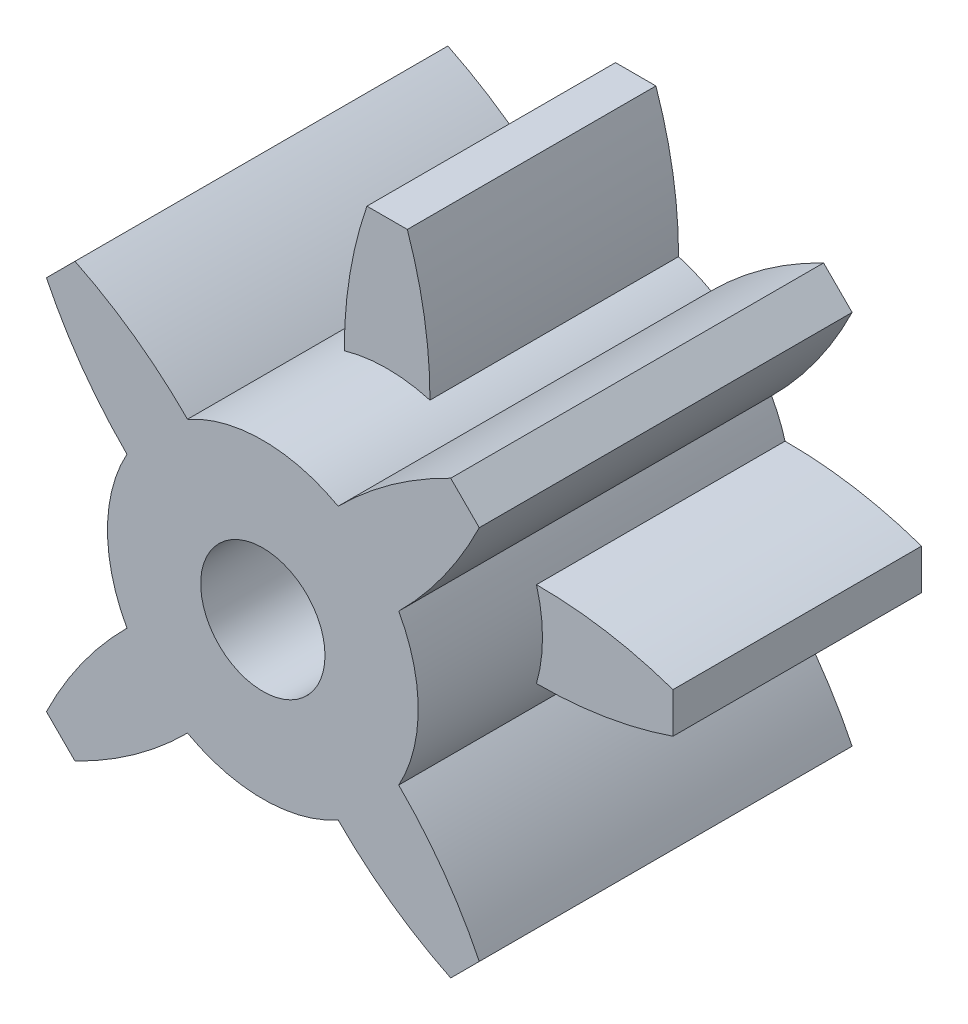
from build123d import *

# Parameters (mm, degrees)
SKETCH_1_R          = 12.5
SKETCH_1_R_2        = 5
EXTRUDE_1_DEPTH     = 30
CUT_EXTRUDE_START   = -10
CUT_EXTRUDE_1_DEPTH = 10


with BuildPart() as part:
    # Sketch 1 → Extrude 1 (new body)
    # profile 1 of 9: a face of its own
    with BuildSketch(Plane.XY):
        with Locations((0, 63)):
            Circle(SKETCH_1_R)
        with Locations((0, 63)):
            Circle(SKETCH_1_R_2, mode=Mode.SUBTRACT)
    # profile 2 of 9: a face of its own
    with BuildSketch(Plane.XY):
        with BuildLine():
            ThreePointArc((-17.412504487, 78.114407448), (-14.553577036, 73.314633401), (-10.932746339, 69.060120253))
            ThreePointArc((-10.932746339, 69.060120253), (-8.838834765, 71.838834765), (-6.060120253, 73.932746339))
            ThreePointArc((-6.060120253, 73.932746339), (-10.314633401, 77.553577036), (-15.114407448, 80.412504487))
            Line((-15.114407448, 80.412504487), (-17.412504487, 78.114407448))
        make_face()
    # profile 3 of 9: a face of its own
    with BuildSketch(Plane.XY):
        with BuildLine():
            ThreePointArc((-1.625, 86), (-2.997385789, 80.584480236), (-3.445466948, 75.015771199))
            ThreePointArc((-3.445466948, 75.015771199), (0, 75.5), (3.445466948, 75.015771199))
            ThreePointArc((3.445466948, 75.015771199), (2.997385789, 80.584480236), (1.625, 86))
            Line((1.625, 86), (-1.625, 86))
        make_face()
    # profile 4 of 9: a face of its own
    with BuildSketch(Plane.XY):
        with BuildLine():
            ThreePointArc((6.060120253, 73.932746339), (8.838834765, 71.838834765), (10.932746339, 69.060120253))
            ThreePointArc((10.932746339, 69.060120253), (14.553577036, 73.314633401), (17.412504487, 78.114407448))
            Line((17.412504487, 78.114407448), (15.114407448, 80.412504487))
            ThreePointArc((15.114407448, 80.412504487), (10.314633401, 77.553577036), (6.060120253, 73.932746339))
        make_face()
    # profile 5 of 9: a face of its own
    with BuildSketch(Plane.XY):
        with BuildLine():
            ThreePointArc((12.5, 63), (12.378350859, 61.260336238), (12.015771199, 59.554533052))
            ThreePointArc((12.015771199, 59.554533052), (17.584480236, 60.002614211), (23, 61.375))
            Line((23, 61.375), (23, 64.625))
            ThreePointArc((23, 64.625), (17.584480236, 65.997385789), (12.015771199, 66.445466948))
            ThreePointArc((12.015771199, 66.445466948), (12.378350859, 64.739663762), (12.5, 63))
        make_face()
    # profile 6 of 9: a face of its own
    with BuildSketch(Plane.XY):
        with BuildLine():
            ThreePointArc((10.932746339, 56.939879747), (8.838834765, 54.161165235), (6.060120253, 52.067253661))
            ThreePointArc((6.060120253, 52.067253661), (10.314633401, 48.446422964), (15.114407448, 45.587495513))
            Line((15.114407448, 45.587495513), (17.412504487, 47.885592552))
            ThreePointArc((17.412504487, 47.885592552), (14.553577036, 52.685366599), (10.932746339, 56.939879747))
        make_face()
    # profile 7 of 9: a face of its own
    with BuildSketch(Plane.XY):
        with BuildLine():
            ThreePointArc((-3.445466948, 50.984228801), (-2.997385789, 45.415519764), (-1.625, 40))
            Line((-1.625, 40), (1.625, 40))
            ThreePointArc((1.625, 40), (2.997385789, 45.415519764), (3.445466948, 50.984228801))
            ThreePointArc((3.445466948, 50.984228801), (0, 50.5), (-3.445466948, 50.984228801))
        make_face()
    # profile 8 of 9: a face of its own
    with BuildSketch(Plane.XY):
        with BuildLine():
            ThreePointArc((-15.114407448, 45.587495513), (-10.314633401, 48.446422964), (-6.060120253, 52.067253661))
            ThreePointArc((-6.060120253, 52.067253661), (-8.838834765, 54.161165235), (-10.932746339, 56.939879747))
            ThreePointArc((-10.932746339, 56.939879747), (-14.553577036, 52.685366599), (-17.412504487, 47.885592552))
            Line((-17.412504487, 47.885592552), (-15.114407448, 45.587495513))
        make_face()
    # profile 9 of 9: a face of its own
    with BuildSketch(Plane.XY):
        with BuildLine():
            ThreePointArc((-23, 61.375), (-17.584480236, 60.002614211), (-12.015771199, 59.554533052))
            ThreePointArc((-12.015771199, 59.554533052), (-12.5, 63), (-12.015771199, 66.445466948))
            ThreePointArc((-12.015771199, 66.445466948), (-17.584480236, 65.997385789), (-23, 64.625))
            Line((-23, 64.625), (-23, 61.375))
        make_face()
    extrude(amount=EXTRUDE_1_DEPTH)

    # Sketch 3 → Cut-Extrude 1 (cut)
    with BuildSketch(Plane.XY.offset(30).offset(CUT_EXTRUDE_START)):
        with BuildLine():
            ThreePointArc((-12.015771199, 59.554533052), (-12.5, 63), (-12.015771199, 66.445466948))
            ThreePointArc((-12.015771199, 66.445466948), (-17.584480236, 65.997385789), (-23, 64.625))
            Line((-23, 64.625), (-23, 61.375))
            ThreePointArc((-23, 61.375), (-17.584480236, 60.002614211), (-12.015771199, 59.554533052))
        make_face()
        with BuildLine():
            ThreePointArc((23, 64.625), (17.584480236, 65.997385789), (12.015771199, 66.445466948))
            ThreePointArc((12.015771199, 66.445466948), (12.378350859, 64.739663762), (12.5, 63))
            ThreePointArc((12.5, 63), (12.378350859, 61.260336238), (12.015771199, 59.554533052))
            ThreePointArc((12.015771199, 59.554533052), (17.584480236, 60.002614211), (23, 61.375))
            Line((23, 61.375), (23, 64.625))
        make_face()
        with BuildLine():
            ThreePointArc((-3.445466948, 75.015771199), (0, 75.5), (3.445466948, 75.015771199))
            ThreePointArc((3.445466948, 75.015771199), (2.997385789, 80.584480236), (1.625, 86))
            Line((1.625, 86), (-1.625, 86))
            ThreePointArc((-1.625, 86), (-2.997385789, 80.584480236), (-3.445466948, 75.015771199))
        make_face()
        with BuildLine():
            ThreePointArc((1.625, 40), (2.997385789, 45.415519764), (3.445466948, 50.984228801))
            ThreePointArc((3.445466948, 50.984228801), (0, 50.5), (-3.445466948, 50.984228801))
            ThreePointArc((-3.445466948, 50.984228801), (-2.997385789, 45.415519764), (-1.625, 40))
            Line((-1.625, 40), (1.625, 40))
        make_face()
    extrude(amount=CUT_EXTRUDE_1_DEPTH, mode=Mode.SUBTRACT)


solid = part.part
